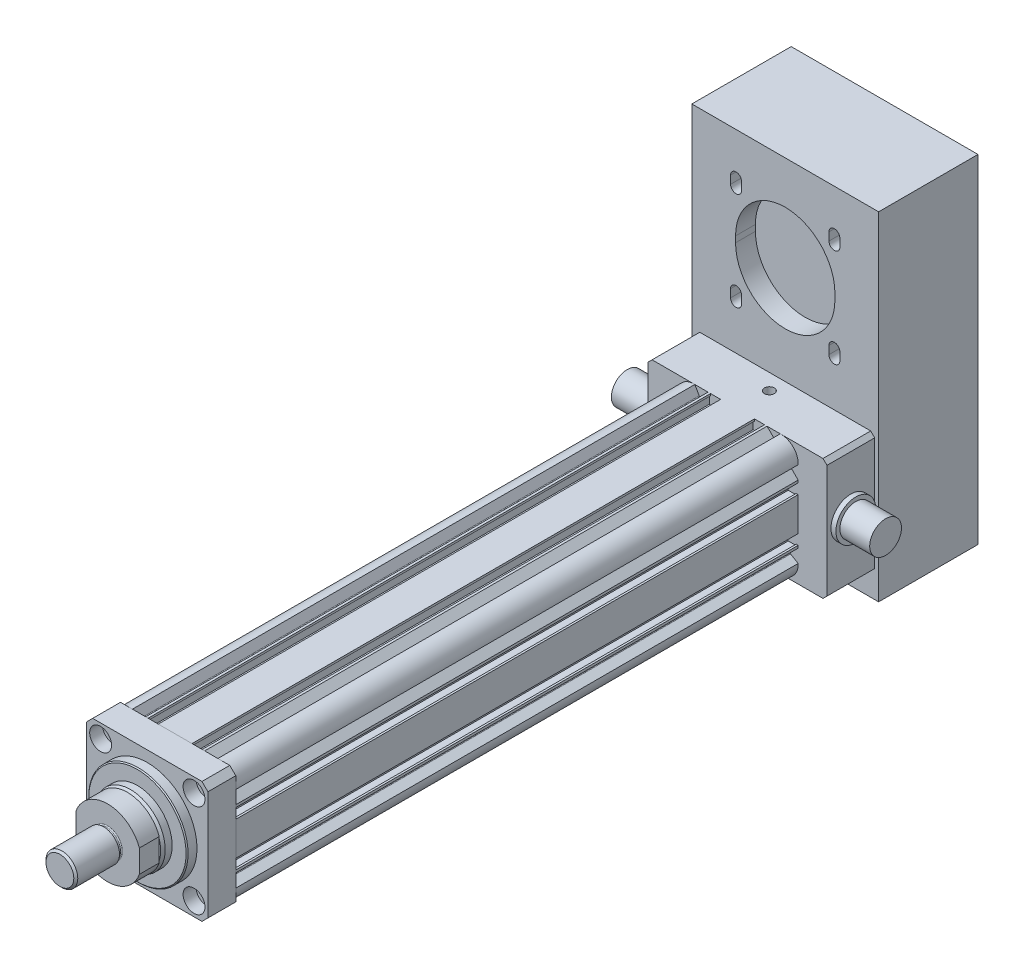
from build123d import *

# Parameters (mm, degrees)
SKETCH_1_R           = 25
SKETCH_1_R_2         = 2.594
EXTRUDE_1_DEPTH      = 283
EXTRUDE_1_2_DEPTH    = 14
SKETCH_3_R           = 4.5
SKETCH_3_R_2         = 3.5
CUT_EXTRUDE_3_DEPTH  = 14
SKETCH_3_5_R         = 5.5
CUT_EXTRUDE_4_DEPTH  = 6.5
SKETCH_5_R           = 25
EXTRUDE_2_DEPTH      = 5
CHAMFER_1_SIZE       = 0.5
SKETCH_6_R           = 17.5
EXTRUDE_3_DEPTH      = 5
CHAMFER_2_SIZE       = 1.5
CHAMFER_2_SIZE2      = 0.8
EXTRUDE_4_DEPTH      = 10
SKETCH_8_R           = 7
EXTRUDE_5_DEPTH      = 2
SKETCH_9_R           = 8
EXTRUDE_6_DEPTH      = 22
CHAMFER_3_SIZE       = 1
FILLET_1_R           = 0.5
SKETCH_10_W          = 90
SKETCH_10_H          = 61
EXTRUDE_7_DEPTH      = 24
SKETCH_26_W          = 94
SKETCH_26_H          = 170
EXTRUDE_11_DEPTH     = 50
CUT_EXTRUDE_11_DEPTH = 10
CUT_EXTRUDE_12_DEPTH = 10
CUT_EXTRUDE_START    = -10
CUT_EXTRUDE_13_DEPTH = 5
SKETCH_28_R          = 10
EXTRUDE_12_DEPTH     = 2.5
EXTRUDE_START        = -92.5
SKETCH_28_2_R        = 10
EXTRUDE_13_DEPTH     = 2.5
SKETCH_29_R          = 8
EXTRUDE_14_DEPTH     = 20
EXTRUDE_START_2      = -110
SKETCH_29_2_R        = 8
EXTRUDE_15_DEPTH     = 20
CHAMFER_4_SIZE       = 2


with BuildPart() as part:
    # Sketch 1 → Extrude 1 (new body)
    with BuildSketch(Plane.XY):
        with BuildLine():
            Line((30.5, 8.5), (29.5, 8.5))
            Line((29.5, 8.5), (29.5, 7.9))
            Line((29.5, 7.9), (25.5, 7.9))
            Line((25.5, 7.9), (25.5, 14.2))
            Line((25.5, 14.2), (29.5, 14.2))
            Line((29.5, 14.2), (29.5, 13.6))
            Line((29.5, 13.6), (30.5, 13.6))
            Line((30.5, 13.6), (30.5, 14.843551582))
            Line((30.5, 14.843551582), (26.602512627, 18.741038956))
            ThreePointArc((26.602512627, 18.741038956), (26.502994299, 19.034210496), (26.675, 19.29163522))
            Line((26.675, 19.29163522), (30.5, 21.5))
            ThreePointArc((30.5, 21.5), (28.010599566, 28.010599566), (21.5, 30.5))
            Line((21.5, 30.5), (19.29163522, 26.675))
            ThreePointArc((19.29163522, 26.675), (19.034210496, 26.502994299), (18.741038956, 26.602512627))
            Line((18.741038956, 26.602512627), (14.843551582, 30.5))
            Line((14.843551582, 30.5), (13.6, 30.5))
            Line((13.6, 30.5), (13.6, 29.5))
            Line((13.6, 29.5), (14.2, 29.5))
            Line((14.2, 29.5), (14.2, 25.5))
            Line((14.2, 25.5), (7.9, 25.5))
            Line((7.9, 25.5), (7.9, 29.5))
            Line((7.9, 29.5), (8.5, 29.5))
            Line((8.5, 29.5), (8.5, 30.5))
            Line((8.5, 30.5), (-8.5, 30.5))
            Line((-8.5, 30.5), (-8.5, 29.5))
            Line((-8.5, 29.5), (-7.9, 29.5))
            Line((-7.9, 29.5), (-7.9, 25.5))
            Line((-7.9, 25.5), (-14.2, 25.5))
            Line((-14.2, 25.5), (-14.2, 29.5))
            Line((-14.2, 29.5), (-13.6, 29.5))
            Line((-13.6, 29.5), (-13.6, 30.5))
            Line((-13.6, 30.5), (-14.843551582, 30.5))
            Line((-14.843551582, 30.5), (-18.741038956, 26.602512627))
            ThreePointArc((-18.741038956, 26.602512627), (-19.034210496, 26.502994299), (-19.29163522, 26.675))
            Line((-19.29163522, 26.675), (-21.5, 30.5))
            ThreePointArc((-21.5, 30.5), (-28.010599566, 28.010599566), (-30.5, 21.5))
            Line((-30.5, 21.5), (-26.675, 19.29163522))
            ThreePointArc((-26.675, 19.29163522), (-26.502994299, 19.034210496), (-26.602512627, 18.741038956))
            Line((-26.602512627, 18.741038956), (-30.5, 14.843551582))
            Line((-30.5, 14.843551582), (-30.5, 13.6))
            Line((-30.5, 13.6), (-29.5, 13.6))
            Line((-29.5, 13.6), (-29.5, 14.2))
            Line((-29.5, 14.2), (-25.5, 14.2))
            Line((-25.5, 14.2), (-25.5, 7.9))
            Line((-25.5, 7.9), (-29.5, 7.9))
            Line((-29.5, 7.9), (-29.5, 8.5))
            Line((-29.5, 8.5), (-30.5, 8.5))
            Line((-30.5, 8.5), (-30.5, -8.5))
            Line((-30.5, -8.5), (-29.5, -8.5))
            Line((-29.5, -8.5), (-29.5, -7.9))
            Line((-29.5, -7.9), (-25.5, -7.9))
            Line((-25.5, -7.9), (-25.5, -14.2))
            Line((-25.5, -14.2), (-29.5, -14.2))
            Line((-29.5, -14.2), (-29.5, -13.6))
            Line((-29.5, -13.6), (-30.5, -13.6))
            Line((-30.5, -13.6), (-30.5, -14.843551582))
            Line((-30.5, -14.843551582), (-26.602512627, -18.741038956))
            ThreePointArc((-26.602512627, -18.741038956), (-26.502994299, -19.034210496), (-26.675, -19.29163522))
            Line((-26.675, -19.29163522), (-30.5, -21.5))
            ThreePointArc((-30.5, -21.5), (-27.825897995, -28.191225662), (-21, -30.5))
            Line((-21, -30.5), (-18.79163522, -26.675))
            ThreePointArc((-18.79163522, -26.675), (-18.534210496, -26.502994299), (-18.241038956, -26.602512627))
            Line((-18.241038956, -26.602512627), (-14.343551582, -30.5))
            Line((-14.343551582, -30.5), (14.343551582, -30.5))
            Line((14.343551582, -30.5), (18.241038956, -26.602512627))
            ThreePointArc((18.241038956, -26.602512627), (18.534210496, -26.502994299), (18.79163522, -26.675))
            Line((18.79163522, -26.675), (21, -30.5))
            ThreePointArc((21, -30.5), (27.825897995, -28.191225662), (30.5, -21.5))
            Line((30.5, -21.5), (26.675, -19.29163522))
            ThreePointArc((26.675, -19.29163522), (26.502994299, -19.034210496), (26.602512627, -18.741038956))
            Line((26.602512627, -18.741038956), (30.5, -14.843551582))
            Line((30.5, -14.843551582), (30.5, -13.6))
            Line((30.5, -13.6), (29.5, -13.6))
            Line((29.5, -13.6), (29.5, -14.2))
            Line((29.5, -14.2), (25.5, -14.2))
            Line((25.5, -14.2), (25.5, -7.9))
            Line((25.5, -7.9), (29.5, -7.9))
            Line((29.5, -7.9), (29.5, -8.5))
            Line((29.5, -8.5), (30.5, -8.5))
            Line((30.5, -8.5), (30.5, 8.5))
        make_face()
        Circle(SKETCH_1_R, mode=Mode.SUBTRACT)
        with Locations((23.5, -23.5)):
            Circle(SKETCH_1_R_2, mode=Mode.SUBTRACT)
        with Locations((-23.5, -23.5)):
            Circle(SKETCH_1_R_2, mode=Mode.SUBTRACT)
        with Locations((23.5, 23.5)):
            Circle(SKETCH_1_R_2, mode=Mode.SUBTRACT)
        with Locations((-23.5, 23.5)):
            Circle(SKETCH_1_R_2, mode=Mode.SUBTRACT)
        with BuildLine():
            Line((-14.843484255, -26.551505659), (-5.699422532, -26.551505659))
            ThreePointArc((-5.699422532, -26.551505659), (-5.401016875, -26.282393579), (-5.637974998, -25.957866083))
            ThreePointArc((-5.637974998, -25.957866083), (-10.496775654, -24.470016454), (-15.006657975, -22.128520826))
            ThreePointArc((-15.006657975, -22.128520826), (-15.31244973, -22.117932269), (-15.468484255, -22.381131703))
            Line((-15.468484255, -22.381131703), (-15.468484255, -25.926505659))
            Line((-15.468484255, -25.926505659), (-14.843484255, -26.551505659))
        make_face(mode=Mode.SUBTRACT)
        with BuildLine():
            Line((15.037740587, -26.551505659), (5.893678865, -26.551505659))
            ThreePointArc((5.893678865, -26.551505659), (5.595273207, -26.282393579), (5.832231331, -25.957866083))
            ThreePointArc((5.832231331, -25.957866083), (10.691031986, -24.470016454), (15.200914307, -22.128520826))
            ThreePointArc((15.200914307, -22.128520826), (15.506706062, -22.117932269), (15.662740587, -22.381131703))
            Line((15.662740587, -22.381131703), (15.662740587, -25.926505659))
            Line((15.662740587, -25.926505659), (15.037740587, -26.551505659))
        make_face(mode=Mode.SUBTRACT)
        with BuildLine():
            Line((24.057261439, -13.884764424), (23.358946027, -13.481591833))
            ThreePointArc((23.358946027, -13.481591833), (23.055418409, -13.441631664), (22.812535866, -13.628001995))
            Line((22.812535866, -13.628001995), (21.480305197, -15.935493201))
            ThreePointArc((21.480305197, -15.935493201), (21.440345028, -16.239020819), (21.626715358, -16.481903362))
            Line((21.626715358, -16.481903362), (22.892186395, -17.212523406))
            ThreePointArc((22.892186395, -17.212523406), (23.195714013, -17.252483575), (23.438596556, -17.066113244))
            Line((23.438596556, -17.066113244), (24.274264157, -15.618694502))
            ThreePointArc((24.274264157, -15.618694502), (24.317966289, -15.507082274), (24.326638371, -15.387533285))
            Line((24.326638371, -15.387533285), (24.223757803, -14.070923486))
            ThreePointArc((24.223757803, -14.070923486), (24.155411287, -13.964516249), (24.057261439, -13.884764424))
        make_face(mode=Mode.SUBTRACT)
        with BuildLine():
            Line((-24.057261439, -13.884764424), (-23.358946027, -13.481591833))
            ThreePointArc((-23.358946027, -13.481591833), (-23.055418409, -13.441631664), (-22.812535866, -13.628001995))
            Line((-22.812535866, -13.628001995), (-21.480305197, -15.935493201))
            ThreePointArc((-21.480305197, -15.935493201), (-21.440345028, -16.239020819), (-21.626715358, -16.481903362))
            Line((-21.626715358, -16.481903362), (-22.892186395, -17.212523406))
            ThreePointArc((-22.892186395, -17.212523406), (-23.195714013, -17.252483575), (-23.438596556, -17.066113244))
            Line((-23.438596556, -17.066113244), (-24.274264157, -15.618694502))
            ThreePointArc((-24.274264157, -15.618694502), (-24.317966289, -15.507082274), (-24.326638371, -15.387533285))
            Line((-24.326638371, -15.387533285), (-24.223757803, -14.070923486))
            ThreePointArc((-24.223757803, -14.070923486), (-24.155411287, -13.964516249), (-24.057261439, -13.884764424))
        make_face(mode=Mode.SUBTRACT)
        with BuildLine():
            Line((24.057261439, 13.884764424), (23.358946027, 13.481591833))
            ThreePointArc((23.358946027, 13.481591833), (23.055418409, 13.441631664), (22.812535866, 13.628001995))
            Line((22.812535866, 13.628001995), (21.480305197, 15.935493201))
            ThreePointArc((21.480305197, 15.935493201), (21.440345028, 16.239020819), (21.626715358, 16.481903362))
            Line((21.626715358, 16.481903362), (22.892186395, 17.212523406))
            ThreePointArc((22.892186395, 17.212523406), (23.195714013, 17.252483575), (23.438596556, 17.066113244))
            Line((23.438596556, 17.066113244), (24.274264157, 15.618694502))
            ThreePointArc((24.274264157, 15.618694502), (24.317966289, 15.507082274), (24.326638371, 15.387533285))
            Line((24.326638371, 15.387533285), (24.223757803, 14.070923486))
            ThreePointArc((24.223757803, 14.070923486), (24.155411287, 13.964516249), (24.057261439, 13.884764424))
        make_face(mode=Mode.SUBTRACT)
        with BuildLine():
            Line((-24.057261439, 13.884764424), (-23.358946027, 13.481591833))
            ThreePointArc((-23.358946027, 13.481591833), (-23.055418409, 13.441631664), (-22.812535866, 13.628001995))
            Line((-22.812535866, 13.628001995), (-21.480305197, 15.935493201))
            ThreePointArc((-21.480305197, 15.935493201), (-21.440345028, 16.239020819), (-21.626715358, 16.481903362))
            Line((-21.626715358, 16.481903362), (-22.892186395, 17.212523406))
            ThreePointArc((-22.892186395, 17.212523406), (-23.195714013, 17.252483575), (-23.438596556, 17.066113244))
            Line((-23.438596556, 17.066113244), (-24.274264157, 15.618694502))
            ThreePointArc((-24.274264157, 15.618694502), (-24.317966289, 15.507082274), (-24.326638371, 15.387533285))
            Line((-24.326638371, 15.387533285), (-24.223757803, 14.070923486))
            ThreePointArc((-24.223757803, 14.070923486), (-24.155411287, 13.964516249), (-24.057261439, 13.884764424))
        make_face(mode=Mode.SUBTRACT)
        with BuildLine():
            Line((17.761634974, 23.75411276), (17.07315308, 24.68624059))
            ThreePointArc((17.07315308, 24.68624059), (16.934629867, 24.812286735), (16.758415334, 24.87572765))
            Line((16.758415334, 24.87572765), (13.966108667, 25.295529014))
            ThreePointArc((13.966108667, 25.295529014), (13.689318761, 25.25468305), (13.482325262, 25.066441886))
            Line((13.482325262, 25.066441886), (12.839111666, 23.986237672))
            ThreePointArc((12.839111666, 23.986237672), (12.785382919, 23.626185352), (12.999780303, 23.331977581))
            ThreePointArc((12.999780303, 23.331977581), (14.833000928, 22.112125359), (16.576342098, 20.766949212))
            ThreePointArc((16.576342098, 20.766949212), (17.053890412, 20.688035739), (17.357364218, 21.065107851))
            Line((17.357364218, 21.065107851), (17.761634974, 23.75411276))
        make_face(mode=Mode.SUBTRACT)
        with BuildLine():
            Line((-17.761634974, 23.75411276), (-17.07315308, 24.68624059))
            ThreePointArc((-17.07315308, 24.68624059), (-16.934629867, 24.812286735), (-16.758415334, 24.87572765))
            Line((-16.758415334, 24.87572765), (-13.966108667, 25.295529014))
            ThreePointArc((-13.966108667, 25.295529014), (-13.689318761, 25.25468305), (-13.482325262, 25.066441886))
            Line((-13.482325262, 25.066441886), (-12.839111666, 23.986237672))
            ThreePointArc((-12.839111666, 23.986237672), (-12.785382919, 23.626185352), (-12.999780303, 23.331977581))
            ThreePointArc((-12.999780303, 23.331977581), (-14.833000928, 22.112125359), (-16.576342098, 20.766949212))
            ThreePointArc((-16.576342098, 20.766949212), (-17.053890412, 20.688035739), (-17.357364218, 21.065107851))
            Line((-17.357364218, 21.065107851), (-17.761634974, 23.75411276))
        make_face(mode=Mode.SUBTRACT)
    extrude(amount=EXTRUDE_1_DEPTH)

    # Sketch 10 → Extrude 7 (add)
    with BuildSketch(Plane(origin=(0, 0, 0), x_dir=(-1, 0, 0), z_dir=(0, 0, -1))):
        Rectangle(SKETCH_10_W, SKETCH_10_H)
    extrude(amount=EXTRUDE_7_DEPTH)

    # Sketch 15 → Hole Wizard M6 _1 (revolve, cut)
    with BuildSketch(Plane(origin=(0, 30.5, -16), x_dir=(0, 0, 1), z_dir=(1, 0, 0))):
        Polygon((0, 0), (0, 9.502151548), (2.5, 8), (2.5, 0), align=None)
    revolve(axis=Axis((0, 36.85, -16), (0, -1, 0)), mode=Mode.SUBTRACT)

    # Sketch 26 → Extrude 11 (add)
    with BuildSketch(Plane(origin=(0, 0, -24), x_dir=(-1, 0, 0), z_dir=(0, 0, -1))):
        with Locations((0, 43)):
            Rectangle(SKETCH_26_W, SKETCH_26_H)
    extrude(amount=EXTRUDE_11_DEPTH)

    # Sketch 27 → Cut-Extrude 11 (cut)
    with BuildSketch(Plane.XY.offset(-24)):
        with BuildLine():
            Line((-25, 81.5), (-24.999999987, 78.49920032))
            ThreePointArc((-24.999999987, 78.49920032), (0.00039984, 53.500000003), (25, 78.5))
            Line((25, 78.5), (25, 81.5))
            ThreePointArc((25, 81.5), (0, 106.5), (-25, 81.5))
        make_face()
    extrude(amount=-CUT_EXTRUDE_11_DEPTH, mode=Mode.SUBTRACT)

    # Sketch 27_3 → Cut-Extrude 12 (cut)
    with BuildSketch(Plane.XY.offset(-24)):
        with BuildLine():
            Line((-27.498737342, 102.748737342), (-27.498737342, 106.748737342))
            ThreePointArc((-27.498737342, 106.748737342), (-24.748737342, 109.498737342), (-21.998737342, 106.748737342))
            Line((-21.998737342, 106.748737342), (-21.998737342, 102.748737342))
            ThreePointArc((-21.998737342, 102.748737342), (-24.748737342, 99.998737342), (-27.498737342, 102.748737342))
        make_face()
        with BuildLine():
            Line((27.498737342, 102.748737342), (27.498737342, 106.748737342))
            ThreePointArc((27.498737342, 106.748737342), (24.748737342, 109.498737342), (21.998737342, 106.748737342))
            Line((21.998737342, 106.748737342), (21.998737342, 102.748737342))
            ThreePointArc((21.998737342, 102.748737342), (24.748737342, 99.998737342), (27.498737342, 102.748737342))
        make_face()
        with BuildLine():
            Line((27.498737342, 57.251262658), (27.498737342, 53.251262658))
            ThreePointArc((27.498737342, 53.251262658), (24.748737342, 50.501262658), (21.998737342, 53.251262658))
            Line((21.998737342, 53.251262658), (21.998737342, 57.251262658))
            ThreePointArc((21.998737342, 57.251262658), (24.748737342, 60.001262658), (27.498737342, 57.251262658))
        make_face()
        with BuildLine():
            Line((-27.498737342, 57.251262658), (-27.498737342, 53.251262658))
            ThreePointArc((-27.498737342, 53.251262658), (-24.748737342, 50.501262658), (-21.998737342, 53.251262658))
            Line((-21.998737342, 53.251262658), (-21.998737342, 57.251262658))
            ThreePointArc((-21.998737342, 57.251262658), (-24.748737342, 60.001262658), (-27.498737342, 57.251262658))
        make_face()
    extrude(amount=-CUT_EXTRUDE_12_DEPTH, mode=Mode.SUBTRACT)

    # Sketch 27_4 → Cut-Extrude 13 (cut)
    with BuildSketch(Plane.XY.offset(-24).offset(CUT_EXTRUDE_START)):
        with BuildLine():
            Line((-28.848737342, 101.848737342), (-28.848737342, 107.648737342))
            ThreePointArc((-28.848737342, 107.648737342), (-24.748737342, 111.748737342), (-20.648737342, 107.648737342))
            Line((-20.648737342, 107.648737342), (-20.648737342, 101.848737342))
            ThreePointArc((-20.648737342, 101.848737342), (-24.748737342, 97.748737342), (-28.848737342, 101.848737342))
        make_face()
        with BuildLine():
            Line((28.848737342, 101.848737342), (28.848737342, 107.648737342))
            ThreePointArc((28.848737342, 107.648737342), (24.748737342, 111.748737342), (20.648737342, 107.648737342))
            Line((20.648737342, 107.648737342), (20.648737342, 101.848737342))
            ThreePointArc((20.648737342, 101.848737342), (24.748737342, 97.748737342), (28.848737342, 101.848737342))
        make_face()
        with BuildLine():
            Line((28.848737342, 58.151262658), (28.848737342, 52.351262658))
            ThreePointArc((28.848737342, 52.351262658), (24.748737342, 48.251262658), (20.648737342, 52.351262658))
            Line((20.648737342, 52.351262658), (20.648737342, 58.151262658))
            ThreePointArc((20.648737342, 58.151262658), (24.748737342, 62.251262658), (28.848737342, 58.151262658))
        make_face()
        with BuildLine():
            Line((-28.848737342, 58.151262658), (-28.848737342, 52.351262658))
            ThreePointArc((-28.848737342, 52.351262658), (-24.748737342, 48.251262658), (-20.648737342, 52.351262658))
            Line((-20.648737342, 52.351262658), (-20.648737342, 58.151262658))
            ThreePointArc((-20.648737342, 58.151262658), (-24.748737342, 62.251262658), (-28.848737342, 58.151262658))
        make_face()
    extrude(amount=-CUT_EXTRUDE_13_DEPTH, mode=Mode.SUBTRACT)

    # Sketch 28 → Extrude 12 (add)
    with BuildSketch(Plane.ZY.offset(45)):
        with Locations(Location((-12, 0, 0), (0, 0, 90))):
            Circle(SKETCH_28_R)
    extrude(amount=EXTRUDE_12_DEPTH)

    # Sketch 28_2 → Extrude 13 (add)
    with BuildSketch(Plane.ZY.offset(45).offset(EXTRUDE_START)):
        with Locations(Location((-12, 0, 0), (0, 0, 90))):
            Circle(SKETCH_28_2_R)
    extrude(amount=EXTRUDE_13_DEPTH)

    # Sketch 29 → Extrude 14 (add)
    with BuildSketch(Plane.ZY.offset(47.5)):
        with Locations(Location((-12, 0, 0), (0, 0, 270))):
            Circle(SKETCH_29_R)
    extrude(amount=EXTRUDE_14_DEPTH)

    # Sketch 29_2 → Extrude 15 (add)
    with BuildSketch(Plane.ZY.offset(47.5).offset(EXTRUDE_START_2)):
        with Locations(Location((-12, 0, 0), (0, 0, 270))):
            Circle(SKETCH_29_2_R)
    extrude(amount=EXTRUDE_15_DEPTH)

    # Chamfer 4
    chamfer_4_edges = [part.edges().sort_by_distance(p)[0] for p in [
        (-45, -30.5, -12),
        (-45, 30.5, -12),
        (45, 30.5, -12),
        (45, -30.5, -12),
    ]]
    chamfer(chamfer_4_edges, length=CHAMFER_4_SIZE)


with BuildPart() as body_2:
    # Sketch 2 → Extrude 1 2 (new body)
    with BuildSketch(Plane.XY.offset(283)):
        Polygon((-27.5, 30.5), (-30.5, 27.5), (-30.5, -27.5), (-27.5, -30.5), (27.5, -30.5), (30.5, -27.5), (30.5, 27.5), (27.5, 30.5), align=None)
    extrude(amount=EXTRUDE_1_2_DEPTH)

    # Sketch 3 → Cut-Extrude 3 (cut)
    with BuildSketch(Plane.XY.offset(297)):
        with Locations((-40, -20)):
            Circle(SKETCH_3_R)
        with Locations((-23.5, -23.5)):
            Circle(SKETCH_3_R_2)
        with Locations((-23.5, 23.5)):
            Circle(SKETCH_3_R_2)
        with Locations((23.5, 23.5)):
            Circle(SKETCH_3_R_2)
        with Locations((40, 20)):
            Circle(SKETCH_3_R)
        with Locations((40, -20)):
            Circle(SKETCH_3_R)
        with Locations((23.5, -23.5)):
            Circle(SKETCH_3_R_2)
        with Locations((-40, 20)):
            Circle(SKETCH_3_R)
    extrude(amount=-CUT_EXTRUDE_3_DEPTH, mode=Mode.SUBTRACT)

    # Sketch 3_5 → Cut-Extrude 4 (cut)
    with BuildSketch(Plane.XY.offset(297)):
        with Locations((-23.5, 23.5)):
            Circle(SKETCH_3_5_R)
        with Locations((-23.5, -23.5)):
            Circle(SKETCH_3_5_R)
        with Locations((23.5, -23.5)):
            Circle(SKETCH_3_5_R)
        with Locations((23.5, 23.5)):
            Circle(SKETCH_3_5_R)
    extrude(amount=-CUT_EXTRUDE_4_DEPTH, mode=Mode.SUBTRACT)

    # Sketch 5 → Extrude 2 (add)
    with BuildSketch(Plane.XY.offset(297)):
        Circle(SKETCH_5_R)
    extrude(amount=EXTRUDE_2_DEPTH)

    # Chamfer 1
    chamfer_1_edges = [body_2.edges().sort_by_distance(p)[0] for p in [
        (-25, 0, 302),
    ]]
    chamfer(chamfer_1_edges, length=CHAMFER_1_SIZE)

    # Sketch 6 → Extrude 3 (add)
    with BuildSketch(Plane.XY.offset(302)):
        Circle(SKETCH_6_R)
    extrude(amount=EXTRUDE_3_DEPTH)

    # Chamfer 2
    chamfer_2_edges = [body_2.edges().sort_by_distance(p)[0] for p in [
        (-17.5, 0, 307),
    ]]
    chamfer_2_side = [body_2.faces().sort_by_distance(p)[0] for p in [
        (-17.5, 0, 304.5),
    ]]
    chamfer(chamfer_2_edges, length=CHAMFER_2_SIZE, length2=CHAMFER_2_SIZE2, reference=chamfer_2_side[0])

    # Sketch 7 → Extrude 4 (add)
    with BuildSketch(Plane.XY.offset(307)):
        with BuildLine():
            Line((-16, 5.744562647), (-16, -5.744562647))
            ThreePointArc((-16, -5.744562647), (0, -17), (16, -5.744562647))
            Line((16, -5.744562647), (16, 5.744562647))
            ThreePointArc((16, 5.744562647), (0, 17), (-16, 5.744562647))
        make_face()
    extrude(amount=EXTRUDE_4_DEPTH)

    # Sketch 8 → Extrude 5 (add)
    with BuildSketch(Plane.XY.offset(317)):
        Circle(SKETCH_8_R)
    extrude(amount=EXTRUDE_5_DEPTH)

    # Sketch 9 → Extrude 6 (add)
    with BuildSketch(Plane.XY.offset(319)):
        Circle(SKETCH_9_R)
    extrude(amount=EXTRUDE_6_DEPTH)

    # Chamfer 3
    chamfer_3_edges = [body_2.edges().sort_by_distance(p)[0] for p in [
        (-8, 0, 341),
    ]]
    chamfer(chamfer_3_edges, length=CHAMFER_3_SIZE)

    # Fillet 1
    fillet_1_edges = [body_2.edges().sort_by_distance(p)[0] for p in [
        (-7, 0, 317),
    ]]
    fillet(fillet_1_edges, radius=FILLET_1_R)


solid = Compound([part.part, body_2.part])
